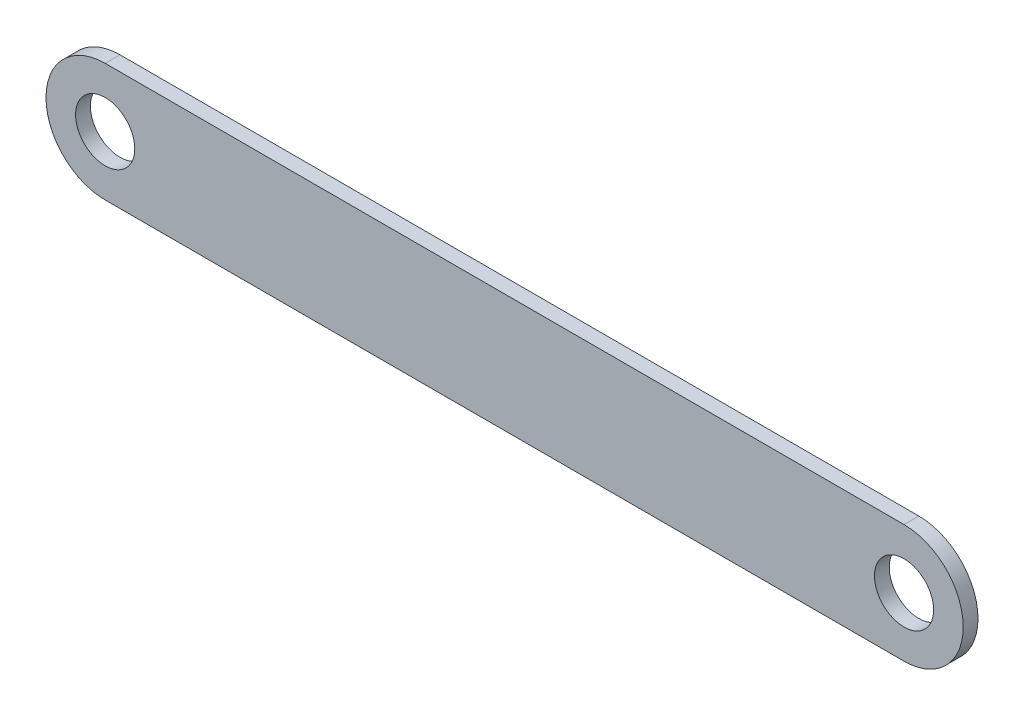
from build123d import *

# Parameters (mm, degrees)
EXTRUDE1_DEPTH     = 5
SKETCH2_R          = 10
CUT_EXTRUDE1_DEPTH = 240.511444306


with BuildPart() as part:
    # Sketch1 → Extrude1 (new body)
    with BuildSketch(Plane.XY):
        with BuildLine():
            Line((51.513050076, 21.557056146), (-218.486949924, 21.557056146))
            ThreePointArc((-218.486949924, 21.557056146), (-238.486949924, 1.557056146), (-218.486949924, -18.442943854))
            Line((-218.486949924, -18.442943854), (51.513050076, -18.442943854))
            ThreePointArc((51.513050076, -18.442943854), (71.513050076, 1.557056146), (51.513050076, 21.557056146))
        make_face()
    extrude(amount=EXTRUDE1_DEPTH)

    # Sketch2 → Cut-Extrude1 (cut, through all)
    with BuildSketch(Plane.XY.offset(5)):
        with Locations((-218.486949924, 1.557056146)):
            Circle(SKETCH2_R)
        with Locations((51.513050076, 1.557056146)):
            Circle(SKETCH2_R)
    extrude(amount=-CUT_EXTRUDE1_DEPTH, mode=Mode.SUBTRACT)


solid = part.part
